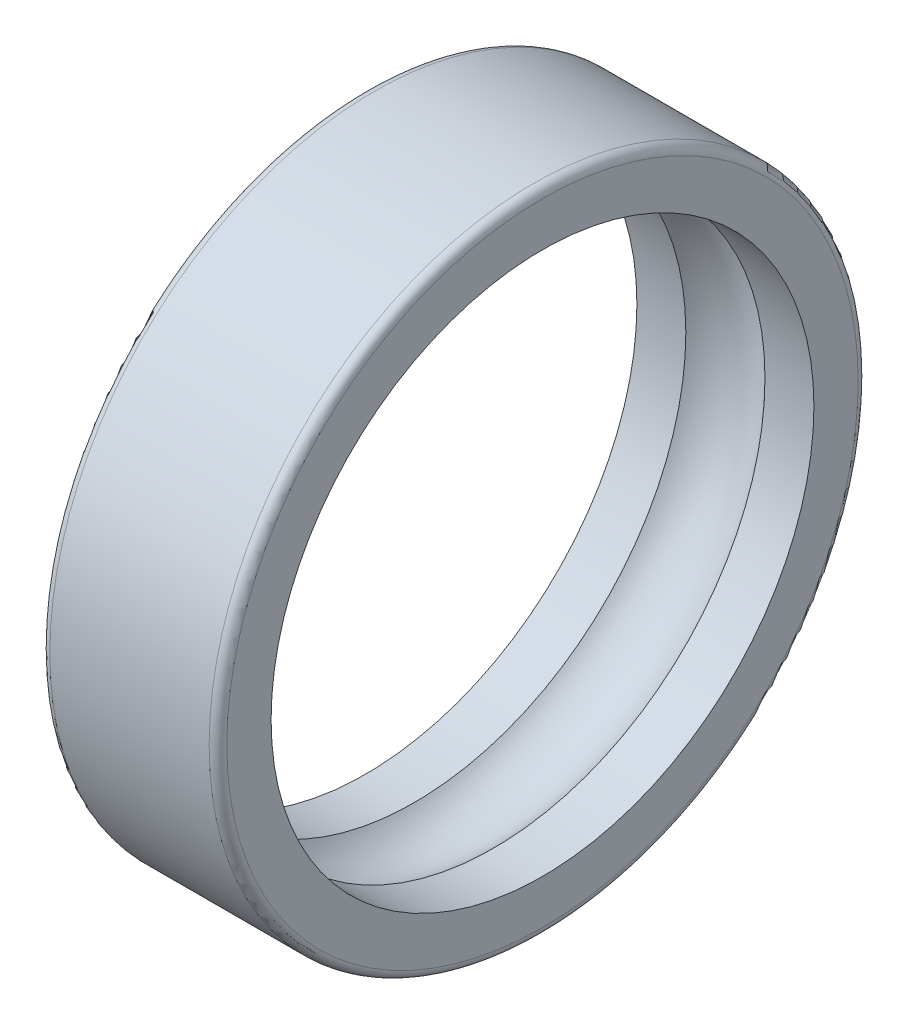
from build123d import *


with BuildPart() as part:
    # Esquisse1 → Base-R_volution (revolve)
    with BuildSketch(Plane(origin=(0, 0, 0), x_dir=(1, 0, 0), z_dir=(0, 1, 0)), mode=Mode.PRIVATE) as base_r_volution_sk:
        with BuildLine():
            Line((0, 10.7), (0, 9.2))
            Line((0, 9.2), (1.658359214, 9.2))
            ThreePointArc((1.658359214, 9.2), (3, 9.8), (4.341640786, 9.2))
            Line((4.341640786, 9.2), (6, 9.2))
            Line((6, 9.2), (6, 10.7))
            ThreePointArc((6, 10.7), (5.912132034, 10.912132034), (5.7, 11))
            Line((5.7, 11), (0.3, 11))
            ThreePointArc((0.3, 11), (0.087867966, 10.912132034), (0, 10.7))
        make_face()
    revolve(base_r_volution_sk.sketch.rotate(Axis((0, 0, 0), (1, 0, 0)), 180), axis=Axis((0, 0, 0), (1, 0, 0)))


solid = part.part
